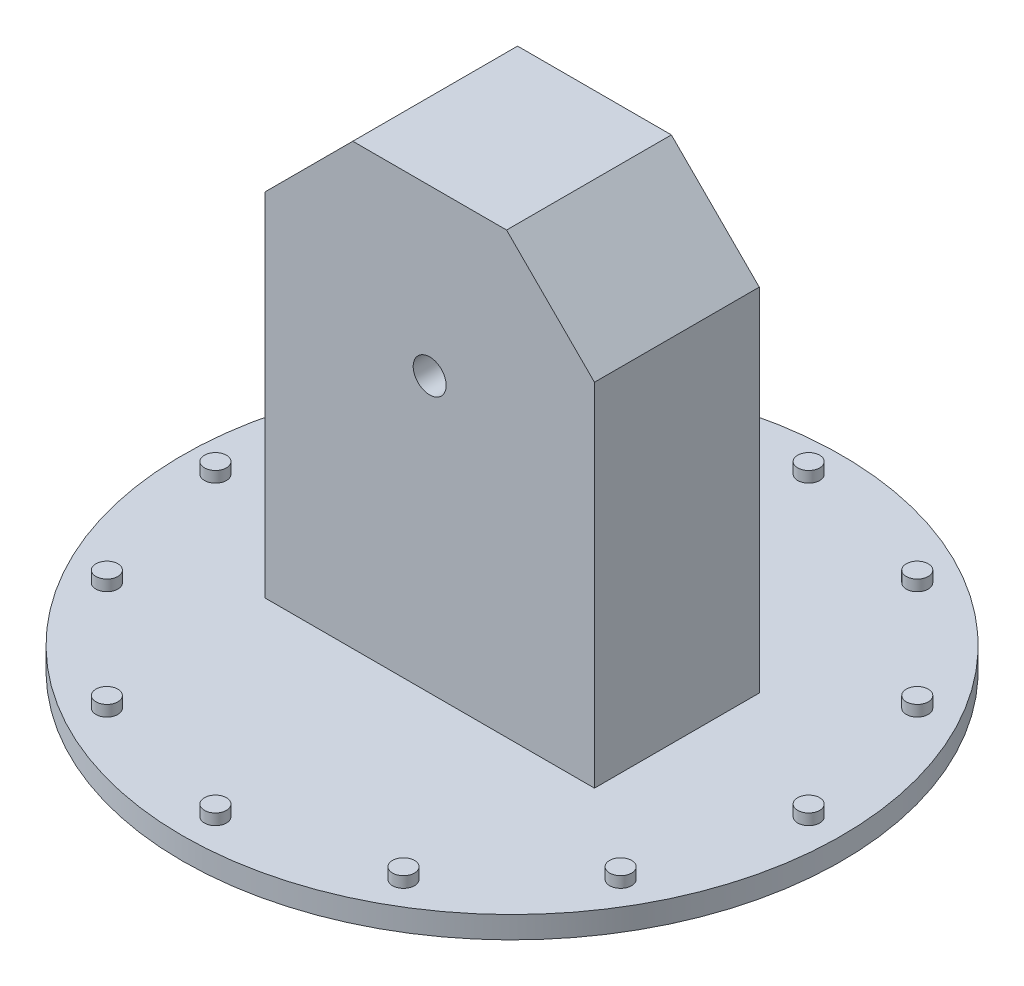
from build123d import *

# Parameters (mm, degrees)
SKETCH1_R                = 300
BOSS_EXTRUDE2_DEPTH      = 20
SKETCH2_R                = 10
BOSS_EXTRUDE3_DEPTH      = 10
CIRPATTERN1_COUNT        = 12
SKETCH3_W                = 300
SKETCH3_H                = 150
BOSS_EXTRUDE4_DEPTH      = 400
CUT_EXTRUDE1_DEPTH       = 129
CUT_EXTRUDE1_DEPTH_BACK  = 220
SKETCH4_R                = 90
BOSS_EXTRUDE5_DEPTH      = 75
BOSS_EXTRUDE5_DEPTH_BACK = 75
SKETCH5_R                = 90
SKETCH5_R_2              = 15


with BuildPart() as part:
    # Sketch1 → Boss-Extrude2 (new body)
    with BuildSketch(Plane(origin=(0, 0, 0), x_dir=(1, 0, 0), z_dir=(0, 1, 0))):
        with Locations(Location((0, 0, 0), (0, 0, 270))):
            Circle(SKETCH1_R)
    extrude(amount=-BOSS_EXTRUDE2_DEPTH)

    # Sketch2 → Boss-Extrude3 (add)
    with BuildSketch(Plane(origin=(0, 0, 0), x_dir=(1, 0, 0), z_dir=(0, 1, 0))):
        with Locations(Location((0, -270, 0), (0, 0, 270))):
            Circle(SKETCH2_R)
    boss_extrude3 = extrude(amount=BOSS_EXTRUDE3_DEPTH)

    # CirPattern1: Boss-Extrude3 ×12 about axis
    cirpattern1_axis = Axis((0, 0, 0), (0, 1, 0))
    for i in range(1, CIRPATTERN1_COUNT):
        add(boss_extrude3.rotate(cirpattern1_axis, i * 360 / CIRPATTERN1_COUNT))

    # Sketch3 → Boss-Extrude4 (add)
    with BuildSketch(Plane(origin=(0, 0, 0), x_dir=(1, 0, 0), z_dir=(0, 1, 0))):
        Rectangle(SKETCH3_W, SKETCH3_H)
    extrude(amount=BOSS_EXTRUDE4_DEPTH)

    # Sketch4 → Cut-Extrude1 (cut, two sides: drawn at the far end of the back side and taken through both)
    with BuildSketch(Plane.XY.offset(-CUT_EXTRUDE1_DEPTH_BACK)):
        with Locations((0, 250)):
            Circle(SKETCH4_R)
        Polygon((-150, 320), (-70, 400), (-137.287286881, 467.287286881), (-241.740269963, 403.389162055), (-209.050858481, 328.2364284), align=None)
        Polygon((70, 400), (150, 320), (186.279055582, 348.043708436), (186.279055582, 448.569953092), (86.038407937, 462.55154351), align=None)
    extrude(amount=CUT_EXTRUDE1_DEPTH + CUT_EXTRUDE1_DEPTH_BACK, mode=Mode.SUBTRACT)

    # Sketch5 → Boss-Extrude5 (add, two sides: drawn at the far end of the back side and taken through both)
    with BuildSketch(Plane.XY.offset(-BOSS_EXTRUDE5_DEPTH_BACK)):
        with Locations((0, 250)):
            Circle(SKETCH5_R)
        with Locations((0, 250)):
            Circle(SKETCH5_R_2, mode=Mode.SUBTRACT)
    extrude(amount=BOSS_EXTRUDE5_DEPTH + BOSS_EXTRUDE5_DEPTH_BACK)


solid = part.part
